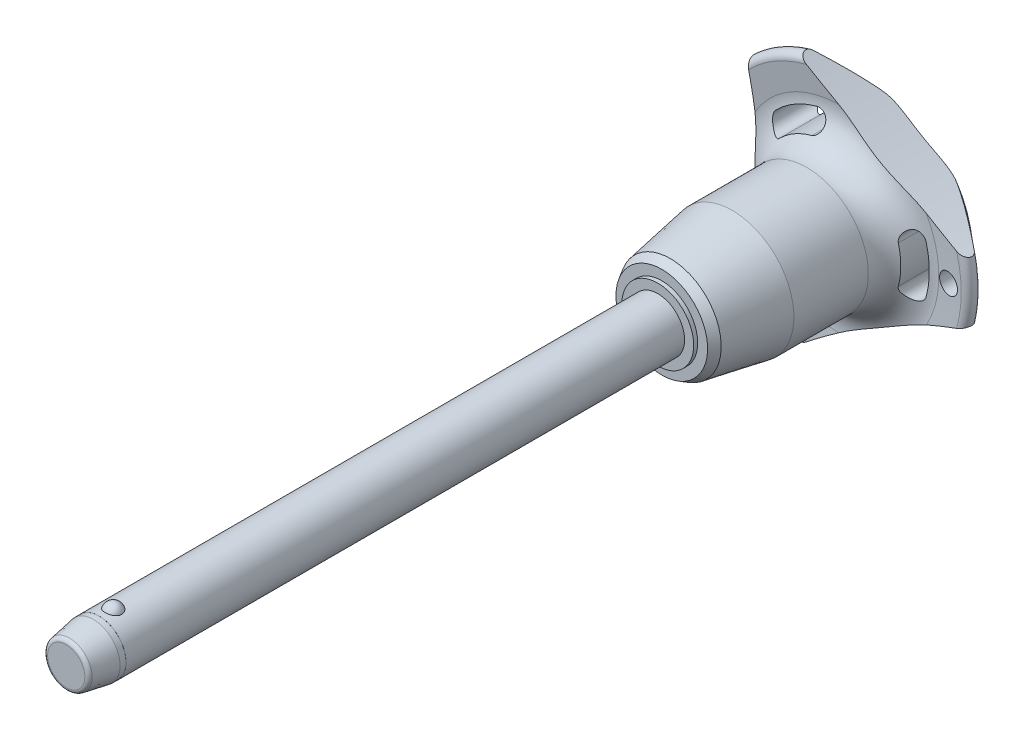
from build123d import *

# Parameters (mm, degrees)
SKETCH1_R           = 4
BOSS_EXTRUDE1_DEPTH = 80
SKETCH2_R           = 3.4
BOSS_EXTRUDE2_DEPTH = 33.3
BOSS_EXTRUDE3_START = 8.2
SKETCH1_2_R         = 4
BOSS_EXTRUDE3_DEPTH = 8.2
CHAMFER1_SIZE       = 4.1
CHAMFER1_SIZE2      = 0.722940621
FILLET1_R           = 0.6
SKETCH6_R           = 102.8
CUT_EXTRUDE1_DEPTH  = 117.644873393
CIRPATTERN1_COUNT   = 3
SKETCH7_R           = 1.5
CUT_EXTRUDE2_DEPTH  = 117.506132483
SKETCH8_R           = 4
SKETCH8_R_2         = 3.99
CUT_EXTRUDE3_DEPTH  = 4.92


with BuildPart() as part:
    # Sketch1 → Boss-Extrude1 (new body)
    with BuildSketch(Plane.XY):
        Circle(SKETCH1_R)
    extrude(amount=-BOSS_EXTRUDE1_DEPTH)

    # Sketch2 → Boss-Extrude2 (add)
    with BuildSketch(Plane(origin=(0, 0, -80), x_dir=(-1, 0, 0), z_dir=(0, 0, -1))):
        Circle(SKETCH2_R)
    extrude(amount=BOSS_EXTRUDE2_DEPTH)

    # Sketch3 → Revolve1 (revolve)
    with BuildSketch(Plane(origin=(0, 0, 0), x_dir=(0, 0, -1), z_dir=(1, 0, 0))):
        with BuildLine():
            Line((-1.2, 4.8), (-1.2, 2.2))
            ThreePointArc((-1.2, 2.2), (0.1, 3.5), (-1.2, 4.8))
        make_face()
        with BuildLine():
            Line((-1.2, -2.2), (-1.2, -4.8))
            ThreePointArc((-1.2, -4.8), (0.1, -3.5), (-1.2, -2.2))
        make_face()
    revolve(axis=Axis((0, -2.2, 1.2), (0, 1, 0)))

    # Sketch1_2 → Boss-Extrude3 (add)
    with BuildSketch(Plane.XY.offset(BOSS_EXTRUDE3_START)):
        Circle(SKETCH1_2_R)
    extrude(amount=-BOSS_EXTRUDE3_DEPTH)

    # Chamfer1
    chamfer1_edges = [part.edges().sort_by_distance(p)[0] for p in [
        (-4, 0, 8.2),
    ]]
    chamfer1_side = [part.faces().sort_by_distance(p)[0] for p in [
        (-4, 0, -35.9),
    ]]
    chamfer(chamfer1_edges, length=CHAMFER1_SIZE, length2=CHAMFER1_SIZE2, reference=chamfer1_side[0])

    # Fillet1
    fillet1_edges = [part.edges().sort_by_distance(p)[0] for p in [
        (-3.277059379, 0, 8.2),
        (3.4, 0, -113.3),
    ]]
    fillet(fillet1_edges, radius=FILLET1_R)

    # Sketch4 → Revolve2 (revolve)
    with BuildSketch(Plane(origin=(0, 0, 0), x_dir=(0, 0, -1), z_dir=(1, 0, 0)), mode=Mode.PRIVATE) as revolve2_sk:
        Polygon((80, 0), (80, 5.353660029), (80.6, 5.353660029), (80.6, 6.834334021), (81.882301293, 7.574671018), (91.1, 9.2), (102.2, 9.2), (102.2, 0), align=None)
    revolve(revolve2_sk.sketch.rotate(Axis((0, 0, -102.2), (0, 0, 1)), 90), axis=Axis((0, 0, -102.2), (0, 0, 1)))

    # Sketch5 → Revolve3 (revolve)
    with BuildSketch(Plane(origin=(0, 0, 0), x_dir=(0, 0, -1), z_dir=(1, 0, 0)), mode=Mode.PRIVATE) as revolve3_sk:
        with BuildLine():
            Line((107.169704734, 14.749576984), (106.756059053, 18.490084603))
            ThreePointArc((106.756059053, 18.490084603), (107.35677658, 19.519442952), (108.516044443, 19.24278761))
            Line((108.516044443, 19.24278761), (112.835691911, 14.094832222))
            ThreePointArc((112.835691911, 14.094832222), (113.3, 12.689260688), (112.67067517, 11.349423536))
            ThreePointArc((112.67067517, 11.349423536), (109.033110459, 6.185112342), (107.75, 0))
            Line((107.75, 0), (102.2, 0))
            Line((102.2, 0), (102.2, 9.2))
            ThreePointArc((102.2, 9.2), (105.924774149, 10.864425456), (107.169704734, 14.749576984))
        make_face()
    revolve(revolve3_sk.sketch.rotate(Axis((0, 0, -107.75), (0, 0, 1)), 90), axis=Axis((0, 0, -107.75), (0, 0, 1)))

    # Sketch6 → Cut-Extrude1 (cut, through all)
    with BuildSketch(Plane.XY):
        with Locations((-115.2, 0)):
            Circle(SKETCH6_R)
        with BuildLine():
            ThreePointArc((12.885043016, -3.538869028), (13.362182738, 0), (12.885043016, 3.538869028))
            ThreePointArc((12.885043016, 3.538869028), (11.179749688, 4.509281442), (10.209337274, 2.803988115))
            ThreePointArc((10.209337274, 2.803988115), (10.587394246, 0), (10.209337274, -2.803988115))
            ThreePointArc((10.209337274, -2.803988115), (11.179749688, -4.509281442), (12.885043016, -3.538869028))
        make_face()
    cut_extrude1 = extrude(amount=-CUT_EXTRUDE1_DEPTH, mode=Mode.SUBTRACT)

    # CirPattern1: Cut-Extrude1 ×3 about axis
    cirpattern1_axis = Axis((0, 0, 0), (0, 0, 1))
    for i in range(1, CIRPATTERN1_COUNT):
        add(cut_extrude1.rotate(cirpattern1_axis, i * 360 / CIRPATTERN1_COUNT), mode=Mode.SUBTRACT)

    # Sketch7 → Cut-Extrude2 (cut, through all)
    with BuildSketch(Plane.XY):
        with Locations(Location((16.362182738, 0, 0), (0, 0, 225.449470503))):
            Circle(SKETCH7_R)
    extrude(amount=-CUT_EXTRUDE2_DEPTH, mode=Mode.SUBTRACT)

    # Sketch8 → Cut-Extrude3 (cut)
    with BuildSketch(Plane.XY.offset(8.2)):
        Circle(SKETCH8_R)
        Circle(SKETCH8_R_2, mode=Mode.SUBTRACT)
    extrude(amount=-CUT_EXTRUDE3_DEPTH, mode=Mode.SUBTRACT)


solid = part.part
